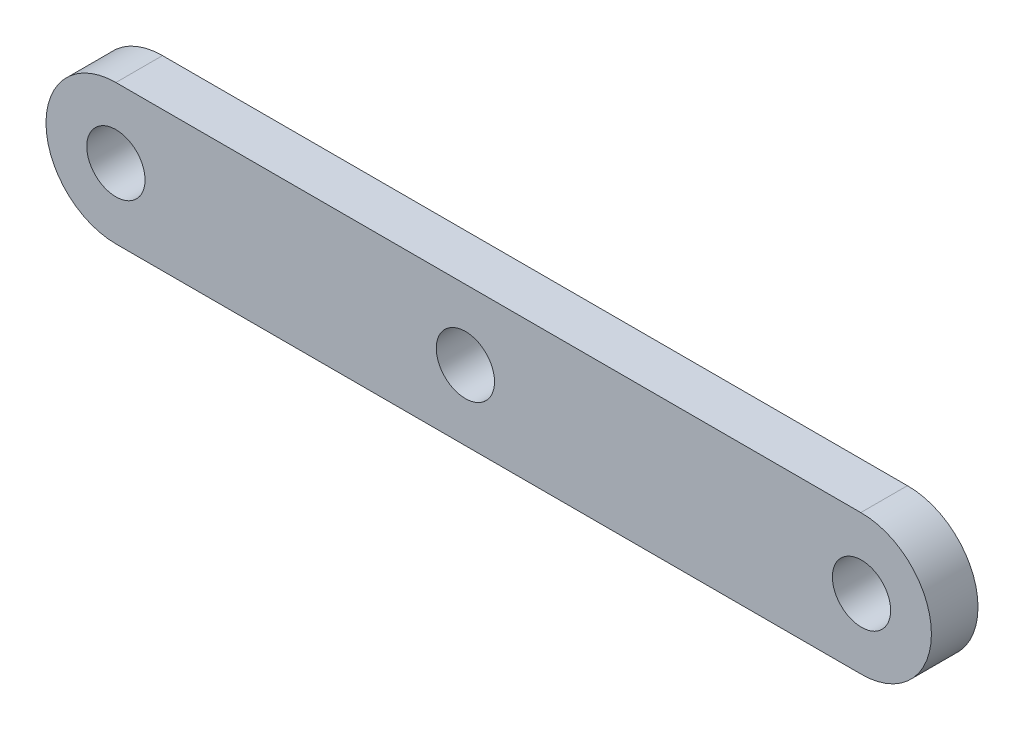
ISO-10303-21;
HEADER;
FILE_DESCRIPTION(('STEP AP214'),'2;1');
FILE_NAME('part.step','',(''),(''),'','','');
FILE_SCHEMA(('AUTOMOTIVE_DESIGN { 1 0 10303 214 1 1 1 1 }'));
ENDSEC;
DATA;
#1=APPLICATION_CONTEXT('core data for automotive mechanical design processes');
#2=APPLICATION_PROTOCOL_DEFINITION('international standard','automotive_design',2000,#1);
#3=PRODUCT_CONTEXT('',#1,'mechanical');
#4=PRODUCT('Part','Part','',(#3));
#5=PRODUCT_RELATED_PRODUCT_CATEGORY('part','',(#4));
#6=PRODUCT_DEFINITION_FORMATION('','',#4);
#7=PRODUCT_DEFINITION_CONTEXT('part definition',#1,'design');
#8=PRODUCT_DEFINITION('design','',#6,#7);
#9=PRODUCT_DEFINITION_SHAPE('','',#8);
#10=(LENGTH_UNIT() NAMED_UNIT(*) SI_UNIT(.MILLI.,.METRE.));
#11=(NAMED_UNIT(*) PLANE_ANGLE_UNIT() SI_UNIT($,.RADIAN.));
#12=(NAMED_UNIT(*) SI_UNIT($,.STERADIAN.) SOLID_ANGLE_UNIT());
#13=UNCERTAINTY_MEASURE_WITH_UNIT(LENGTH_MEASURE(1.E-05),#10,'distance_accuracy_value','');
#14=(GEOMETRIC_REPRESENTATION_CONTEXT(3) GLOBAL_UNCERTAINTY_ASSIGNED_CONTEXT((#13)) GLOBAL_UNIT_ASSIGNED_CONTEXT((#10,
#11,#12)) REPRESENTATION_CONTEXT('',''));
#15=CARTESIAN_POINT('',(0.,0.,0.));
#16=DIRECTION('',(0.,0.,1.));
#17=DIRECTION('',(1.,0.,0.));
#18=AXIS2_PLACEMENT_3D('',#15,#16,#17);
#19=CARTESIAN_POINT('',(2.97854706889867E-05,-5.99992546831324,4.));
#20=DIRECTION('',(-4.96430678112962E-06,0.999999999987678,0.));
#21=DIRECTION('',(-0.999999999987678,-4.96430678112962E-06,0.));
#22=AXIS2_PLACEMENT_3D('',#19,#20,#21);
#23=PLANE('',#22);
#24=DIRECTION('',(0.999999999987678,4.96430678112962E-06,0.));
#25=VECTOR('',#24,1.);
#26=CARTESIAN_POINT('',(2.97854706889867E-05,-5.99992546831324,0.));
#27=LINE('',#26,#25);
#28=CARTESIAN_POINT('',(-14.9990734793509,-5.99999992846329,0.));
#29=VERTEX_POINT('',#28);
#30=CARTESIAN_POINT('',(48.9382779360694,-5.99968252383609,0.));
#31=VERTEX_POINT('',#30);
#32=EDGE_CURVE('E109',#29,#31,#27,.T.);
#33=ORIENTED_EDGE('',*,*,#32,.T.);
#34=DIRECTION('',(0.,0.,-1.));
#35=VECTOR('',#34,1.);
#36=CARTESIAN_POINT('',(48.9382779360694,-5.99968252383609,4.));
#37=LINE('',#36,#35);
#38=CARTESIAN_POINT('',(48.9382779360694,-5.99968252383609,4.));
#39=VERTEX_POINT('',#38);
#40=EDGE_CURVE('E11',#39,#31,#37,.T.);
#41=ORIENTED_EDGE('',*,*,#40,.F.);
#42=DIRECTION('',(0.999999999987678,4.96430678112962E-06,0.));
#43=VECTOR('',#42,1.);
#44=CARTESIAN_POINT('',(2.97854706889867E-05,-5.99992546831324,4.));
#45=LINE('',#44,#43);
#46=CARTESIAN_POINT('',(-14.9990734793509,-5.99999992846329,4.));
#47=VERTEX_POINT('',#46);
#48=EDGE_CURVE('E85',#47,#39,#45,.T.);
#49=ORIENTED_EDGE('',*,*,#48,.F.);
#50=DIRECTION('',(0.,0.,-1.));
#51=VECTOR('',#50,1.);
#52=CARTESIAN_POINT('',(-14.9990734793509,-5.99999992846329,4.));
#53=LINE('',#52,#51);
#54=EDGE_CURVE('E96',#47,#29,#53,.T.);
#55=ORIENTED_EDGE('',*,*,#54,.T.);
#56=EDGE_LOOP('',(#33,#41,#49,#55));
#57=FACE_BOUND('',#56,.T.);
#58=ADVANCED_FACE('F37',(#57),#23,.F.);
#59=CARTESIAN_POINT('',(49.,0.,4.));
#60=DIRECTION('',(0.,0.,-1.));
#61=DIRECTION('',(-1.,0.,0.));
#62=AXIS2_PLACEMENT_3D('',#59,#60,#61);
#63=CYLINDRICAL_SURFACE('',#62,6.);
#64=CARTESIAN_POINT('',(49.,0.,0.));
#65=DIRECTION('',(0.,0.,1.));
#66=DIRECTION('',(1.,0.,0.));
#67=AXIS2_PLACEMENT_3D('',#64,#65,#66);
#68=CIRCLE('',#67,6.);
#69=CARTESIAN_POINT('',(48.9400258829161,5.99970025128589,0.));
#70=VERTEX_POINT('',#69);
#71=EDGE_CURVE('E90',#31,#70,#68,.T.);
#72=ORIENTED_EDGE('',*,*,#71,.T.);
#73=DIRECTION('',(0.,0.,-1.));
#74=VECTOR('',#73,1.);
#75=CARTESIAN_POINT('',(48.9400258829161,5.99970025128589,4.));
#76=LINE('',#75,#74);
#77=CARTESIAN_POINT('',(48.9400258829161,5.99970025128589,4.));
#78=VERTEX_POINT('',#77);
#79=EDGE_CURVE('E46',#78,#70,#76,.T.);
#80=ORIENTED_EDGE('',*,*,#79,.F.);
#81=CARTESIAN_POINT('',(49.,0.,4.));
#82=DIRECTION('',(0.,0.,1.));
#83=DIRECTION('',(1.,0.,0.));
#84=AXIS2_PLACEMENT_3D('',#81,#82,#83);
#85=CIRCLE('',#84,6.);
#86=EDGE_CURVE('E80',#39,#78,#85,.T.);
#87=ORIENTED_EDGE('',*,*,#86,.F.);
#88=ORIENTED_EDGE('',*,*,#40,.T.);
#89=EDGE_LOOP('',(#72,#80,#87,#88));
#90=FACE_BOUND('',#89,.T.);
#91=ADVANCED_FACE('F89',(#90),#63,.T.);
#92=CARTESIAN_POINT('',(2.81274707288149E-05,5.99992968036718,4.));
#93=DIRECTION('',(4.6879667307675E-06,0.999999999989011,0.));
#94=DIRECTION('',(-0.999999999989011,4.6879667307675E-06,0.));
#95=AXIS2_PLACEMENT_3D('',#92,#93,#94);
#96=PLANE('',#95);
#97=DIRECTION('',(0.999999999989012,-4.6879667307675E-06,0.));
#98=VECTOR('',#97,1.);
#99=CARTESIAN_POINT('',(2.81274707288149E-05,5.99992968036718,0.));
#100=LINE('',#99,#98);
#101=CARTESIAN_POINT('',(-15.,6.,0.));
#102=VERTEX_POINT('',#101);
#103=EDGE_CURVE('E113',#102,#70,#100,.T.);
#104=ORIENTED_EDGE('',*,*,#103,.F.);
#105=DIRECTION('',(0.,0.,-1.));
#106=VECTOR('',#105,1.);
#107=CARTESIAN_POINT('',(-15.,6.,4.));
#108=LINE('',#107,#106);
#109=CARTESIAN_POINT('',(-15.,6.,4.));
#110=VERTEX_POINT('',#109);
#111=EDGE_CURVE('E70',#110,#102,#108,.T.);
#112=ORIENTED_EDGE('',*,*,#111,.F.);
#113=DIRECTION('',(0.999999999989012,-4.6879667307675E-06,0.));
#114=VECTOR('',#113,1.);
#115=CARTESIAN_POINT('',(2.81274707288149E-05,5.99992968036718,4.));
#116=LINE('',#115,#114);
#117=EDGE_CURVE('E83',#110,#78,#116,.T.);
#118=ORIENTED_EDGE('',*,*,#117,.T.);
#119=ORIENTED_EDGE('',*,*,#79,.T.);
#120=EDGE_LOOP('',(#104,#112,#118,#119));
#121=FACE_BOUND('',#120,.T.);
#122=ADVANCED_FACE('F94',(#121),#96,.T.);
#123=CARTESIAN_POINT('',(-15.,0.,4.));
#124=DIRECTION('',(0.,0.,-1.));
#125=DIRECTION('',(-1.,0.,0.));
#126=AXIS2_PLACEMENT_3D('',#123,#124,#125);
#127=CYLINDRICAL_SURFACE('',#126,2.5);
#128=CARTESIAN_POINT('',(-15.,0.,4.));
#129=DIRECTION('',(0.,0.,1.));
#130=DIRECTION('',(1.,0.,0.));
#131=AXIS2_PLACEMENT_3D('',#128,#129,#130);
#132=CIRCLE('',#131,2.5);
#133=CARTESIAN_POINT('',(-12.5,0.,4.));
#134=VERTEX_POINT('',#133);
#135=EDGE_CURVE('E160',#134,#134,#132,.T.);
#136=ORIENTED_EDGE('',*,*,#135,.T.);
#137=EDGE_LOOP('',(#136));
#138=FACE_BOUND('',#137,.T.);
#139=CARTESIAN_POINT('',(-15.,0.,0.));
#140=DIRECTION('',(0.,0.,1.));
#141=DIRECTION('',(1.,0.,0.));
#142=AXIS2_PLACEMENT_3D('',#139,#140,#141);
#143=CIRCLE('',#142,2.5);
#144=CARTESIAN_POINT('',(-12.5,0.,0.));
#145=VERTEX_POINT('',#144);
#146=EDGE_CURVE('E106',#145,#145,#143,.T.);
#147=ORIENTED_EDGE('',*,*,#146,.F.);
#148=EDGE_LOOP('',(#147));
#149=FACE_BOUND('',#148,.T.);
#150=ADVANCED_FACE('F141',(#138,#149),#127,.F.);
#151=CARTESIAN_POINT('',(49.,0.,4.));
#152=DIRECTION('',(0.,0.,-1.));
#153=DIRECTION('',(-1.,0.,0.));
#154=AXIS2_PLACEMENT_3D('',#151,#152,#153);
#155=CYLINDRICAL_SURFACE('',#154,2.5);
#156=CARTESIAN_POINT('',(49.,0.,4.));
#157=DIRECTION('',(0.,0.,1.));
#158=DIRECTION('',(1.,0.,0.));
#159=AXIS2_PLACEMENT_3D('',#156,#157,#158);
#160=CIRCLE('',#159,2.5);
#161=CARTESIAN_POINT('',(51.5,0.,4.));
#162=VERTEX_POINT('',#161);
#163=EDGE_CURVE('E154',#162,#162,#160,.T.);
#164=ORIENTED_EDGE('',*,*,#163,.T.);
#165=EDGE_LOOP('',(#164));
#166=FACE_BOUND('',#165,.T.);
#167=CARTESIAN_POINT('',(49.,0.,0.));
#168=DIRECTION('',(0.,0.,1.));
#169=DIRECTION('',(1.,0.,0.));
#170=AXIS2_PLACEMENT_3D('',#167,#168,#169);
#171=CIRCLE('',#170,2.5);
#172=CARTESIAN_POINT('',(51.5,0.,0.));
#173=VERTEX_POINT('',#172);
#174=EDGE_CURVE('E103',#173,#173,#171,.T.);
#175=ORIENTED_EDGE('',*,*,#174,.F.);
#176=EDGE_LOOP('',(#175));
#177=FACE_BOUND('',#176,.T.);
#178=ADVANCED_FACE('F143',(#166,#177),#155,.F.);
#179=CARTESIAN_POINT('',(15.,0.,4.));
#180=DIRECTION('',(0.,0.,-1.));
#181=DIRECTION('',(-1.,0.,0.));
#182=AXIS2_PLACEMENT_3D('',#179,#180,#181);
#183=CYLINDRICAL_SURFACE('',#182,2.5);
#184=CARTESIAN_POINT('',(15.,0.,4.));
#185=DIRECTION('',(0.,0.,1.));
#186=DIRECTION('',(1.,0.,0.));
#187=AXIS2_PLACEMENT_3D('',#184,#185,#186);
#188=CIRCLE('',#187,2.5);
#189=CARTESIAN_POINT('',(17.5,0.,4.));
#190=VERTEX_POINT('',#189);
#191=EDGE_CURVE('E116',#190,#190,#188,.T.);
#192=ORIENTED_EDGE('',*,*,#191,.T.);
#193=EDGE_LOOP('',(#192));
#194=FACE_BOUND('',#193,.T.);
#195=CARTESIAN_POINT('',(15.,0.,0.));
#196=DIRECTION('',(0.,0.,1.));
#197=DIRECTION('',(1.,0.,0.));
#198=AXIS2_PLACEMENT_3D('',#195,#196,#197);
#199=CIRCLE('',#198,2.5);
#200=CARTESIAN_POINT('',(17.5,0.,0.));
#201=VERTEX_POINT('',#200);
#202=EDGE_CURVE('E100',#201,#201,#199,.T.);
#203=ORIENTED_EDGE('',*,*,#202,.F.);
#204=EDGE_LOOP('',(#203));
#205=FACE_BOUND('',#204,.T.);
#206=ADVANCED_FACE('F39',(#194,#205),#183,.F.);
#207=CARTESIAN_POINT('',(-15.,0.,4.));
#208=DIRECTION('',(0.,0.,-1.));
#209=DIRECTION('',(-1.,0.,0.));
#210=AXIS2_PLACEMENT_3D('',#207,#208,#209);
#211=CYLINDRICAL_SURFACE('',#210,6.);
#212=CARTESIAN_POINT('',(-15.,0.,0.));
#213=DIRECTION('',(0.,0.,1.));
#214=DIRECTION('',(1.,0.,0.));
#215=AXIS2_PLACEMENT_3D('',#212,#213,#214);
#216=CIRCLE('',#215,6.);
#217=EDGE_CURVE('E73',#102,#29,#216,.T.);
#218=ORIENTED_EDGE('',*,*,#217,.T.);
#219=ORIENTED_EDGE('',*,*,#54,.F.);
#220=CARTESIAN_POINT('',(-15.,0.,4.));
#221=DIRECTION('',(0.,0.,1.));
#222=DIRECTION('',(1.,0.,0.));
#223=AXIS2_PLACEMENT_3D('',#220,#221,#222);
#224=CIRCLE('',#223,6.);
#225=EDGE_CURVE('E54',#110,#47,#224,.T.);
#226=ORIENTED_EDGE('',*,*,#225,.F.);
#227=ORIENTED_EDGE('',*,*,#111,.T.);
#228=EDGE_LOOP('',(#218,#219,#226,#227));
#229=FACE_BOUND('',#228,.T.);
#230=ADVANCED_FACE('F128',(#229),#211,.T.);
#231=CARTESIAN_POINT('',(0.,0.,4.));
#232=DIRECTION('',(0.,0.,1.));
#233=DIRECTION('',(1.,0.,0.));
#234=AXIS2_PLACEMENT_3D('',#231,#232,#233);
#235=PLANE('',#234);
#236=ORIENTED_EDGE('',*,*,#191,.F.);
#237=EDGE_LOOP('',(#236));
#238=FACE_BOUND('',#237,.T.);
#239=ORIENTED_EDGE('',*,*,#163,.F.);
#240=EDGE_LOOP('',(#239));
#241=FACE_BOUND('',#240,.T.);
#242=ORIENTED_EDGE('',*,*,#135,.F.);
#243=EDGE_LOOP('',(#242));
#244=FACE_BOUND('',#243,.T.);
#245=ORIENTED_EDGE('',*,*,#48,.T.);
#246=ORIENTED_EDGE('',*,*,#86,.T.);
#247=ORIENTED_EDGE('',*,*,#117,.F.);
#248=ORIENTED_EDGE('',*,*,#225,.T.);
#249=EDGE_LOOP('',(#245,#246,#247,#248));
#250=FACE_BOUND('',#249,.T.);
#251=ADVANCED_FACE('F81',(#238,#241,#244,#250),#235,.T.);
#252=CARTESIAN_POINT('',(0.,0.,0.));
#253=DIRECTION('',(0.,0.,1.));
#254=DIRECTION('',(1.,0.,0.));
#255=AXIS2_PLACEMENT_3D('',#252,#253,#254);
#256=PLANE('',#255);
#257=ORIENTED_EDGE('',*,*,#202,.T.);
#258=EDGE_LOOP('',(#257));
#259=FACE_BOUND('',#258,.T.);
#260=ORIENTED_EDGE('',*,*,#174,.T.);
#261=EDGE_LOOP('',(#260));
#262=FACE_BOUND('',#261,.T.);
#263=ORIENTED_EDGE('',*,*,#146,.T.);
#264=EDGE_LOOP('',(#263));
#265=FACE_BOUND('',#264,.T.);
#266=ORIENTED_EDGE('',*,*,#32,.F.);
#267=ORIENTED_EDGE('',*,*,#217,.F.);
#268=ORIENTED_EDGE('',*,*,#103,.T.);
#269=ORIENTED_EDGE('',*,*,#71,.F.);
#270=EDGE_LOOP('',(#266,#267,#268,#269));
#271=FACE_BOUND('',#270,.T.);
#272=ADVANCED_FACE('F121',(#259,#262,#265,#271),#256,.F.);
#273=CLOSED_SHELL('',(#58,#91,#122,#150,#178,#206,#230,#251,#272));
#274=MANIFOLD_SOLID_BREP('B2',#273);
#275=ADVANCED_BREP_SHAPE_REPRESENTATION('',(#18,#274),#14);
#276=SHAPE_DEFINITION_REPRESENTATION(#9,#275);
ENDSEC;
END-ISO-10303-21;
